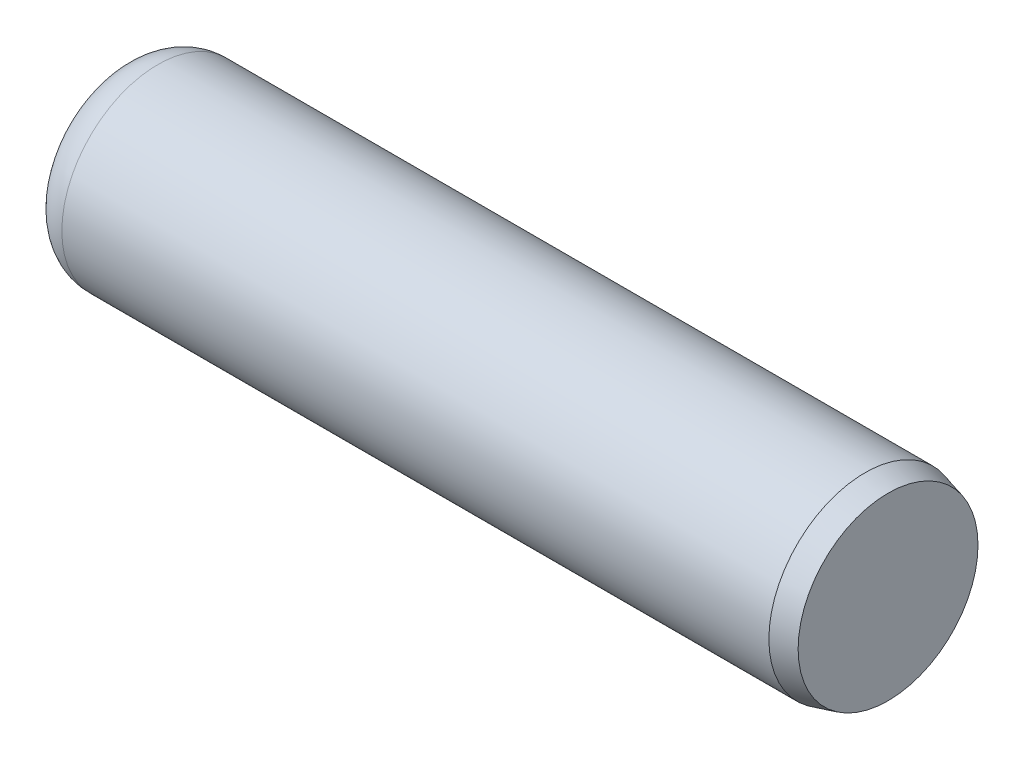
from build123d import *


with BuildPart() as part:
    # Sketch1 → Base-Revolve (revolve)
    with BuildSketch(Plane.XY, mode=Mode.PRIVATE) as base_revolve_sk:
        with BuildLine():
            Line((0, 0), (9.525, 0))
            Line((9.525, 0), (9.525, 1.114652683))
            Line((9.525, 1.114652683), (9.2390976, 1.19126))
            Line((9.2390976, 1.19126), (0.476504, 1.19126))
            ThreePointArc((0.476504, 1.19126), (0.13956479, 1.05169521), (0, 0.714756))
            Line((0, 0.714756), (0, 0))
        make_face()
    revolve(base_revolve_sk.sketch.rotate(Axis((-6.35, 0, 0), (1, 0, 0)), 90), axis=Axis((-6.35, 0, 0), (1, 0, 0)))


solid = part.part
